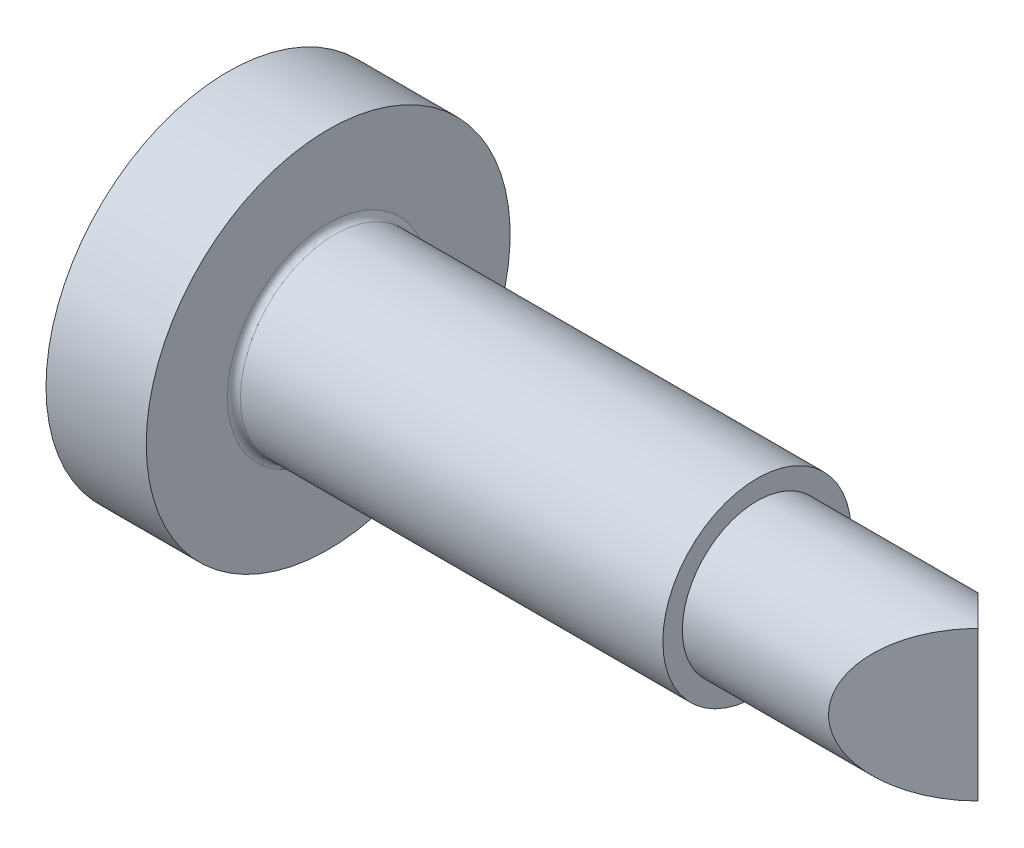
from build123d import *

# Parameters (mm, degrees)
FILLET1_R               = 0.1
CUT_EXTRUDE1_DEPTH      = 14.016912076
CUT_EXTRUDE1_DEPTH_BACK = 14.016912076
CROSSRECESS_DEPTH       = 0.8
FILLET2_R               = 0.3
DRAFT1_ANGLE            = -25
CUT_EXTRUDE3_DEPTH      = 0.8


with BuildPart() as part:
    # Sketch1 → Base (revolve)
    with BuildSketch(Plane.XY, mode=Mode.PRIVATE) as base_sk:
        with BuildLine():
            Line((2.4, 1.45), (9, 1.45))
            Line((9, 1.45), (9, 1.15))
            Line((9, 1.15), (12.4, 1.15))
            Line((12.4, 1.15), (12.4, 0))
            Line((12.4, 0), (0, 0))
            ThreePointArc((0, 0), (0.219188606, 1.464186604), (0.857536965, 2.8))
            Line((0.857536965, 2.8), (2.4, 2.8))
            Line((2.4, 2.8), (2.4, 1.45))
        make_face()
    revolve(base_sk.sketch.rotate(Axis((-43.159349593, 0, 0), (1, 0, 0)), 90), axis=Axis((-43.159349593, 0, 0), (1, 0, 0)))

    # Fillet1
    fillet1_edges = [part.edges().sort_by_distance(p)[0] for p in [
        (2.4, 0, -1.45),
    ]]
    fillet(fillet1_edges, radius=FILLET1_R)

    # Sketch2 → Cut-Extrude1 (cut, two sides: drawn at the far end of the back side and taken through both)
    with BuildSketch(Plane(origin=(0, 0, 0), x_dir=(1, 0, 0), z_dir=(0, 1, 0)).offset(-CUT_EXTRUDE1_DEPTH_BACK)):
        Polygon((12.4, 0), (11.25, 1.15), (11.25, 1.874585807), (12.75845128, 1.874585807), (12.75845128, -1.874585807), (11.25, -1.874585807), (11.25, -1.15), align=None)
    extrude(amount=CUT_EXTRUDE1_DEPTH + CUT_EXTRUDE1_DEPTH_BACK, mode=Mode.SUBTRACT)

    # Sketch3 → CrossRecess (cut)
    with BuildSketch(Plane(origin=(0, 0, 0), x_dir=(0, 0, -1), z_dir=(1, 0, 0))):
        Polygon((-0.3, 0.3), (-1.5, 0.3), (-1.5, -0.3), (-0.3, -0.3), (-0.3, -1.5), (0.3, -1.5), (0.3, -0.3), (1.5, -0.3), (1.5, 0.3), (0.3, 0.3), (0.3, 1.5), (-0.3, 1.5), align=None)
    extrude(amount=CROSSRECESS_DEPTH, mode=Mode.SUBTRACT)

    # Fillet2
    fillet2_edges = [part.edges().sort_by_distance(p)[0] for p in [
        (0.409016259, -0.3, -0.3),
        (0.409016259, 0.3, -0.3),
        (0.409016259, 0.3, 0.3),
        (0.409016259, -0.3, 0.3),
    ]]
    fillet(fillet2_edges, radius=FILLET2_R)

    # Draft1
    draft1_faces = [part.faces().sort_by_distance(p)[0] for p in [
        (0.516718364, -1.5, 0),
        (0.516718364, 0, -1.5),
        (0.516718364, 0, 1.5),
        (0.516718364, 1.5, 0),
    ]]
    draft(draft1_faces, Plane(origin=(0, 0, 0), x_dir=(0, 0, 1), z_dir=(1, 0, 0)), DRAFT1_ANGLE)

    # Sketch4 → Cut-Extrude3 (cut)
    with BuildSketch(Plane(origin=(0, 0, 0), x_dir=(0, 0, -1), z_dir=(1, 0, 0))):
        Polygon((0, 0.448287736), (1.060660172, 1.060660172), (0.448287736, 0), (1.060660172, -1.060660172), (0, -0.448287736), (-1.060660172, -1.060660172), (-0.448287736, 0), (-1.060660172, 1.060660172), align=None)
    extrude(amount=CUT_EXTRUDE3_DEPTH, mode=Mode.SUBTRACT)


solid = part.part
